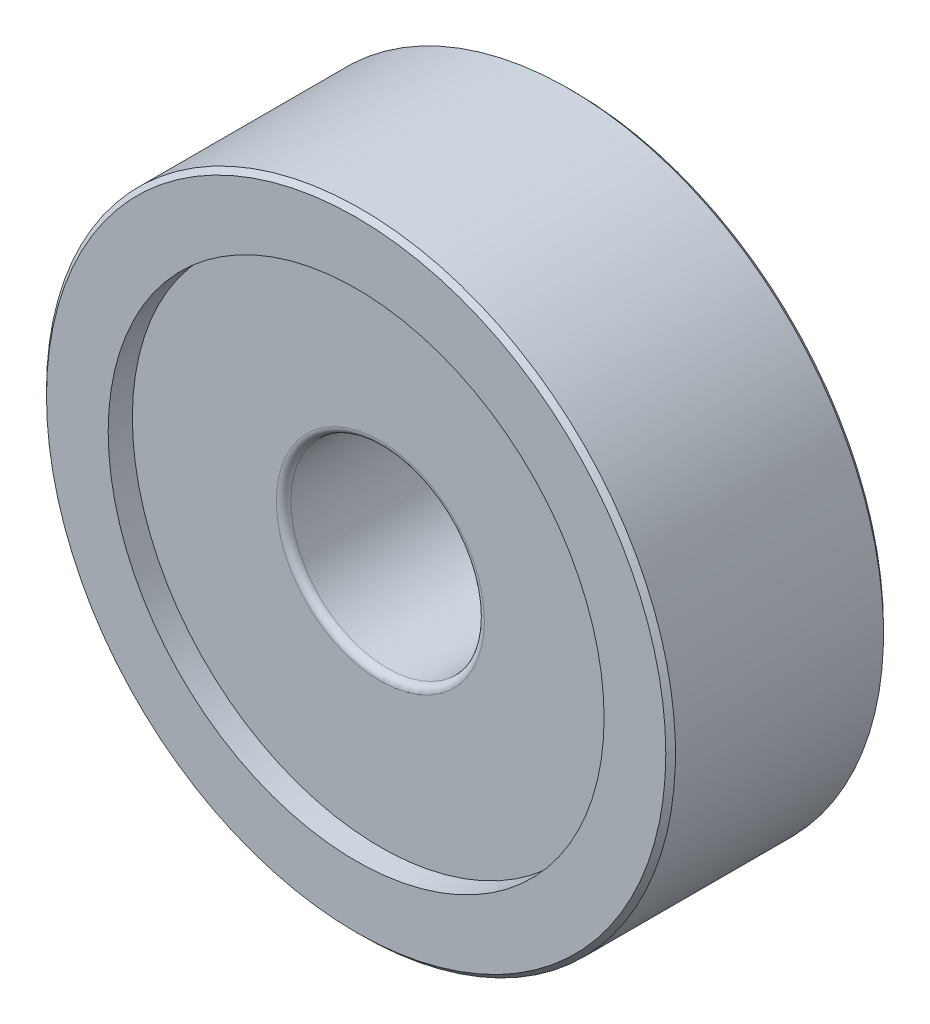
ISO-10303-21;
HEADER;
FILE_DESCRIPTION(('STEP AP214'),'2;1');
FILE_NAME('part.step','',(''),(''),'','','');
FILE_SCHEMA(('AUTOMOTIVE_DESIGN { 1 0 10303 214 1 1 1 1 }'));
ENDSEC;
DATA;
#1=APPLICATION_CONTEXT('core data for automotive mechanical design processes');
#2=APPLICATION_PROTOCOL_DEFINITION('international standard','automotive_design',2000,#1);
#3=PRODUCT_CONTEXT('',#1,'mechanical');
#4=PRODUCT('Part','Part','',(#3));
#5=PRODUCT_RELATED_PRODUCT_CATEGORY('part','',(#4));
#6=PRODUCT_DEFINITION_FORMATION('','',#4);
#7=PRODUCT_DEFINITION_CONTEXT('part definition',#1,'design');
#8=PRODUCT_DEFINITION('design','',#6,#7);
#9=PRODUCT_DEFINITION_SHAPE('','',#8);
#10=(LENGTH_UNIT() NAMED_UNIT(*) SI_UNIT(.MILLI.,.METRE.));
#11=(NAMED_UNIT(*) PLANE_ANGLE_UNIT() SI_UNIT($,.RADIAN.));
#12=(NAMED_UNIT(*) SI_UNIT($,.STERADIAN.) SOLID_ANGLE_UNIT());
#13=UNCERTAINTY_MEASURE_WITH_UNIT(LENGTH_MEASURE(1.E-05),#10,'distance_accuracy_value','');
#14=(GEOMETRIC_REPRESENTATION_CONTEXT(3) GLOBAL_UNCERTAINTY_ASSIGNED_CONTEXT((#13)) GLOBAL_UNIT_ASSIGNED_CONTEXT((#10,
#11,#12)) REPRESENTATION_CONTEXT('',''));
#15=CARTESIAN_POINT('',(0.,0.,0.));
#16=DIRECTION('',(0.,0.,1.));
#17=DIRECTION('',(1.,0.,0.));
#18=AXIS2_PLACEMENT_3D('',#15,#16,#17);
#19=CARTESIAN_POINT('',(0.,14.8,-4.5));
#20=DIRECTION('',(0.,0.,1.));
#21=DIRECTION('',(1.,0.,0.));
#22=AXIS2_PLACEMENT_3D('',#19,#20,#21);
#23=PLANE('',#22);
#24=CARTESIAN_POINT('',(0.,0.,-4.5));
#25=DIRECTION('',(0.,0.,1.));
#26=DIRECTION('',(1.,0.,0.));
#27=AXIS2_PLACEMENT_3D('',#24,#25,#26);
#28=CIRCLE('',#27,10.25);
#29=CARTESIAN_POINT('',(10.25,0.,-4.5));
#30=VERTEX_POINT('',#29);
#31=EDGE_CURVE('E32',#30,#30,#28,.T.);
#32=ORIENTED_EDGE('',*,*,#31,.T.);
#33=EDGE_LOOP('',(#32));
#34=FACE_BOUND('',#33,.T.);
#35=CARTESIAN_POINT('',(0.,0.,-4.5));
#36=DIRECTION('',(0.,0.,-1.));
#37=DIRECTION('',(-1.,0.,0.));
#38=AXIS2_PLACEMENT_3D('',#35,#36,#37);
#39=CIRCLE('',#38,12.8);
#40=CARTESIAN_POINT('',(-12.8,0.,-4.5));
#41=VERTEX_POINT('',#40);
#42=EDGE_CURVE('E44',#41,#41,#39,.T.);
#43=ORIENTED_EDGE('',*,*,#42,.T.);
#44=EDGE_LOOP('',(#43));
#45=FACE_BOUND('',#44,.T.);
#46=ADVANCED_FACE('F12',(#34,#45),#23,.F.);
#47=CARTESIAN_POINT('',(0.,14.8,4.5));
#48=DIRECTION('',(0.,0.,-1.));
#49=DIRECTION('',(-1.,0.,0.));
#50=AXIS2_PLACEMENT_3D('',#47,#48,#49);
#51=PLANE('',#50);
#52=CARTESIAN_POINT('',(0.,0.,4.5));
#53=DIRECTION('',(0.,0.,1.));
#54=DIRECTION('',(1.,0.,0.));
#55=AXIS2_PLACEMENT_3D('',#52,#53,#54);
#56=CIRCLE('',#55,10.25);
#57=CARTESIAN_POINT('',(10.25,0.,4.5));
#58=VERTEX_POINT('',#57);
#59=EDGE_CURVE('E35',#58,#58,#56,.T.);
#60=ORIENTED_EDGE('',*,*,#59,.F.);
#61=EDGE_LOOP('',(#60));
#62=FACE_BOUND('',#61,.T.);
#63=CARTESIAN_POINT('',(0.,0.,4.5));
#64=DIRECTION('',(0.,0.,-1.));
#65=DIRECTION('',(-1.,0.,0.));
#66=AXIS2_PLACEMENT_3D('',#63,#64,#65);
#67=CIRCLE('',#66,12.8);
#68=CARTESIAN_POINT('',(-12.8,0.,4.5));
#69=VERTEX_POINT('',#68);
#70=EDGE_CURVE('E53',#69,#69,#67,.T.);
#71=ORIENTED_EDGE('',*,*,#70,.F.);
#72=EDGE_LOOP('',(#71));
#73=FACE_BOUND('',#72,.T.);
#74=ADVANCED_FACE('F59',(#62,#73),#51,.F.);
#75=CARTESIAN_POINT('',(0.,0.,3.2));
#76=DIRECTION('',(0.,0.,1.));
#77=DIRECTION('',(1.,0.,0.));
#78=AXIS2_PLACEMENT_3D('',#75,#76,#77);
#79=TOROIDAL_SURFACE('',#78,4.3,0.3);
#80=CARTESIAN_POINT('',(0.,0.,3.2));
#81=DIRECTION('',(0.,0.,1.));
#82=DIRECTION('',(1.,0.,0.));
#83=AXIS2_PLACEMENT_3D('',#80,#81,#82);
#84=CIRCLE('',#83,4.);
#85=CARTESIAN_POINT('',(4.,0.,3.2));
#86=VERTEX_POINT('',#85);
#87=EDGE_CURVE('E8',#86,#86,#84,.T.);
#88=ORIENTED_EDGE('',*,*,#87,.F.);
#89=EDGE_LOOP('',(#88));
#90=FACE_BOUND('',#89,.T.);
#91=CARTESIAN_POINT('',(0.,0.,3.5));
#92=DIRECTION('',(0.,0.,1.));
#93=DIRECTION('',(1.,0.,0.));
#94=AXIS2_PLACEMENT_3D('',#91,#92,#93);
#95=CIRCLE('',#94,4.3);
#96=CARTESIAN_POINT('',(4.3,0.,3.5));
#97=VERTEX_POINT('',#96);
#98=EDGE_CURVE('E41',#97,#97,#95,.T.);
#99=ORIENTED_EDGE('',*,*,#98,.T.);
#100=EDGE_LOOP('',(#99));
#101=FACE_BOUND('',#100,.T.);
#102=ADVANCED_FACE('F14',(#90,#101),#79,.T.);
#103=CARTESIAN_POINT('',(0.,0.,7.5));
#104=DIRECTION('',(0.,0.,1.));
#105=DIRECTION('',(1.,0.,0.));
#106=AXIS2_PLACEMENT_3D('',#103,#104,#105);
#107=CYLINDRICAL_SURFACE('',#106,4.);
#108=CARTESIAN_POINT('',(0.,0.,-3.2));
#109=DIRECTION('',(0.,0.,1.));
#110=DIRECTION('',(1.,0.,0.));
#111=AXIS2_PLACEMENT_3D('',#108,#109,#110);
#112=CIRCLE('',#111,4.);
#113=CARTESIAN_POINT('',(4.,0.,-3.2));
#114=VERTEX_POINT('',#113);
#115=EDGE_CURVE('E19',#114,#114,#112,.T.);
#116=ORIENTED_EDGE('',*,*,#115,.F.);
#117=EDGE_LOOP('',(#116));
#118=FACE_BOUND('',#117,.T.);
#119=ORIENTED_EDGE('',*,*,#87,.T.);
#120=EDGE_LOOP('',(#119));
#121=FACE_BOUND('',#120,.T.);
#122=ADVANCED_FACE('F68',(#118,#121),#107,.F.);
#123=CARTESIAN_POINT('',(0.,0.,-3.2));
#124=DIRECTION('',(0.,0.,1.));
#125=DIRECTION('',(1.,0.,0.));
#126=AXIS2_PLACEMENT_3D('',#123,#124,#125);
#127=TOROIDAL_SURFACE('',#126,4.3,0.299999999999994);
#128=CARTESIAN_POINT('',(0.,0.,-3.5));
#129=DIRECTION('',(0.,0.,1.));
#130=DIRECTION('',(1.,0.,0.));
#131=AXIS2_PLACEMENT_3D('',#128,#129,#130);
#132=CIRCLE('',#131,4.3);
#133=CARTESIAN_POINT('',(4.3,0.,-3.5));
#134=VERTEX_POINT('',#133);
#135=EDGE_CURVE('E23',#134,#134,#132,.T.);
#136=ORIENTED_EDGE('',*,*,#135,.F.);
#137=EDGE_LOOP('',(#136));
#138=FACE_BOUND('',#137,.T.);
#139=ORIENTED_EDGE('',*,*,#115,.T.);
#140=EDGE_LOOP('',(#139));
#141=FACE_BOUND('',#140,.T.);
#142=ADVANCED_FACE('F84',(#138,#141),#127,.T.);
#143=CARTESIAN_POINT('',(0.,4.3,-3.5));
#144=DIRECTION('',(0.,0.,1.));
#145=DIRECTION('',(1.,0.,0.));
#146=AXIS2_PLACEMENT_3D('',#143,#144,#145);
#147=PLANE('',#146);
#148=CARTESIAN_POINT('',(0.,0.,-3.5));
#149=DIRECTION('',(0.,0.,1.));
#150=DIRECTION('',(1.,0.,0.));
#151=AXIS2_PLACEMENT_3D('',#148,#149,#150);
#152=CIRCLE('',#151,10.25);
#153=CARTESIAN_POINT('',(10.25,0.,-3.5));
#154=VERTEX_POINT('',#153);
#155=EDGE_CURVE('E27',#154,#154,#152,.T.);
#156=ORIENTED_EDGE('',*,*,#155,.F.);
#157=EDGE_LOOP('',(#156));
#158=FACE_BOUND('',#157,.T.);
#159=ORIENTED_EDGE('',*,*,#135,.T.);
#160=EDGE_LOOP('',(#159));
#161=FACE_BOUND('',#160,.T.);
#162=ADVANCED_FACE('F80',(#158,#161),#147,.F.);
#163=CARTESIAN_POINT('',(0.,0.,7.5));
#164=DIRECTION('',(0.,0.,1.));
#165=DIRECTION('',(1.,0.,0.));
#166=AXIS2_PLACEMENT_3D('',#163,#164,#165);
#167=CYLINDRICAL_SURFACE('',#166,10.25);
#168=ORIENTED_EDGE('',*,*,#31,.F.);
#169=EDGE_LOOP('',(#168));
#170=FACE_BOUND('',#169,.T.);
#171=ORIENTED_EDGE('',*,*,#155,.T.);
#172=EDGE_LOOP('',(#171));
#173=FACE_BOUND('',#172,.T.);
#174=ADVANCED_FACE('F77',(#170,#173),#167,.F.);
#175=CARTESIAN_POINT('',(0.,0.,7.5));
#176=DIRECTION('',(0.,0.,1.));
#177=DIRECTION('',(1.,0.,0.));
#178=AXIS2_PLACEMENT_3D('',#175,#176,#177);
#179=CYLINDRICAL_SURFACE('',#178,10.25);
#180=CARTESIAN_POINT('',(0.,0.,3.5));
#181=DIRECTION('',(0.,0.,1.));
#182=DIRECTION('',(1.,0.,0.));
#183=AXIS2_PLACEMENT_3D('',#180,#181,#182);
#184=CIRCLE('',#183,10.25);
#185=CARTESIAN_POINT('',(10.25,0.,3.5));
#186=VERTEX_POINT('',#185);
#187=EDGE_CURVE('E38',#186,#186,#184,.T.);
#188=ORIENTED_EDGE('',*,*,#187,.F.);
#189=EDGE_LOOP('',(#188));
#190=FACE_BOUND('',#189,.T.);
#191=ORIENTED_EDGE('',*,*,#59,.T.);
#192=EDGE_LOOP('',(#191));
#193=FACE_BOUND('',#192,.T.);
#194=ADVANCED_FACE('F74',(#190,#193),#179,.F.);
#195=CARTESIAN_POINT('',(0.,10.25,3.5));
#196=DIRECTION('',(0.,0.,-1.));
#197=DIRECTION('',(-1.,0.,0.));
#198=AXIS2_PLACEMENT_3D('',#195,#196,#197);
#199=PLANE('',#198);
#200=ORIENTED_EDGE('',*,*,#98,.F.);
#201=EDGE_LOOP('',(#200));
#202=FACE_BOUND('',#201,.T.);
#203=ORIENTED_EDGE('',*,*,#187,.T.);
#204=EDGE_LOOP('',(#203));
#205=FACE_BOUND('',#204,.T.);
#206=ADVANCED_FACE('F118',(#202,#205),#199,.F.);
#207=CARTESIAN_POINT('',(0.,0.,-4.3));
#208=DIRECTION('',(0.,0.,1.));
#209=DIRECTION('',(1.,0.,0.));
#210=AXIS2_PLACEMENT_3D('',#207,#208,#209);
#211=CONICAL_SURFACE('',#210,13.,0.785398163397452);
#212=ORIENTED_EDGE('',*,*,#42,.F.);
#213=EDGE_LOOP('',(#212));
#214=FACE_BOUND('',#213,.T.);
#215=CARTESIAN_POINT('',(0.,0.,-4.3));
#216=DIRECTION('',(0.,0.,-1.));
#217=DIRECTION('',(-1.,0.,0.));
#218=AXIS2_PLACEMENT_3D('',#215,#216,#217);
#219=CIRCLE('',#218,13.);
#220=CARTESIAN_POINT('',(-13.,0.,-4.3));
#221=VERTEX_POINT('',#220);
#222=EDGE_CURVE('E47',#221,#221,#219,.T.);
#223=ORIENTED_EDGE('',*,*,#222,.T.);
#224=EDGE_LOOP('',(#223));
#225=FACE_BOUND('',#224,.T.);
#226=ADVANCED_FACE('F126',(#214,#225),#211,.T.);
#227=CARTESIAN_POINT('',(0.,0.,0.766812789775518));
#228=DIRECTION('',(0.,0.,-1.));
#229=DIRECTION('',(-1.,0.,0.));
#230=AXIS2_PLACEMENT_3D('',#227,#228,#229);
#231=CYLINDRICAL_SURFACE('',#230,13.);
#232=ORIENTED_EDGE('',*,*,#222,.F.);
#233=EDGE_LOOP('',(#232));
#234=FACE_BOUND('',#233,.T.);
#235=CARTESIAN_POINT('',(0.,0.,4.3));
#236=DIRECTION('',(0.,0.,-1.));
#237=DIRECTION('',(-1.,0.,0.));
#238=AXIS2_PLACEMENT_3D('',#235,#236,#237);
#239=CIRCLE('',#238,13.);
#240=CARTESIAN_POINT('',(-13.,0.,4.3));
#241=VERTEX_POINT('',#240);
#242=EDGE_CURVE('E50',#241,#241,#239,.T.);
#243=ORIENTED_EDGE('',*,*,#242,.T.);
#244=EDGE_LOOP('',(#243));
#245=FACE_BOUND('',#244,.T.);
#246=ADVANCED_FACE('F134',(#234,#245),#231,.T.);
#247=CARTESIAN_POINT('',(0.,0.,4.5));
#248=DIRECTION('',(0.,0.,-1.));
#249=DIRECTION('',(-1.,0.,0.));
#250=AXIS2_PLACEMENT_3D('',#247,#248,#249);
#251=CONICAL_SURFACE('',#250,12.8,0.78539816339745);
#252=ORIENTED_EDGE('',*,*,#242,.F.);
#253=EDGE_LOOP('',(#252));
#254=FACE_BOUND('',#253,.T.);
#255=ORIENTED_EDGE('',*,*,#70,.T.);
#256=EDGE_LOOP('',(#255));
#257=FACE_BOUND('',#256,.T.);
#258=ADVANCED_FACE('F57',(#254,#257),#251,.T.);
#259=CLOSED_SHELL('',(#46,#74,#102,#122,#142,#162,#174,#194,#206,#226,#246,#258));
#260=MANIFOLD_SOLID_BREP('B1',#259);
#261=ADVANCED_BREP_SHAPE_REPRESENTATION('',(#18,#260),#14);
#262=SHAPE_DEFINITION_REPRESENTATION(#9,#261);
ENDSEC;
END-ISO-10303-21;
